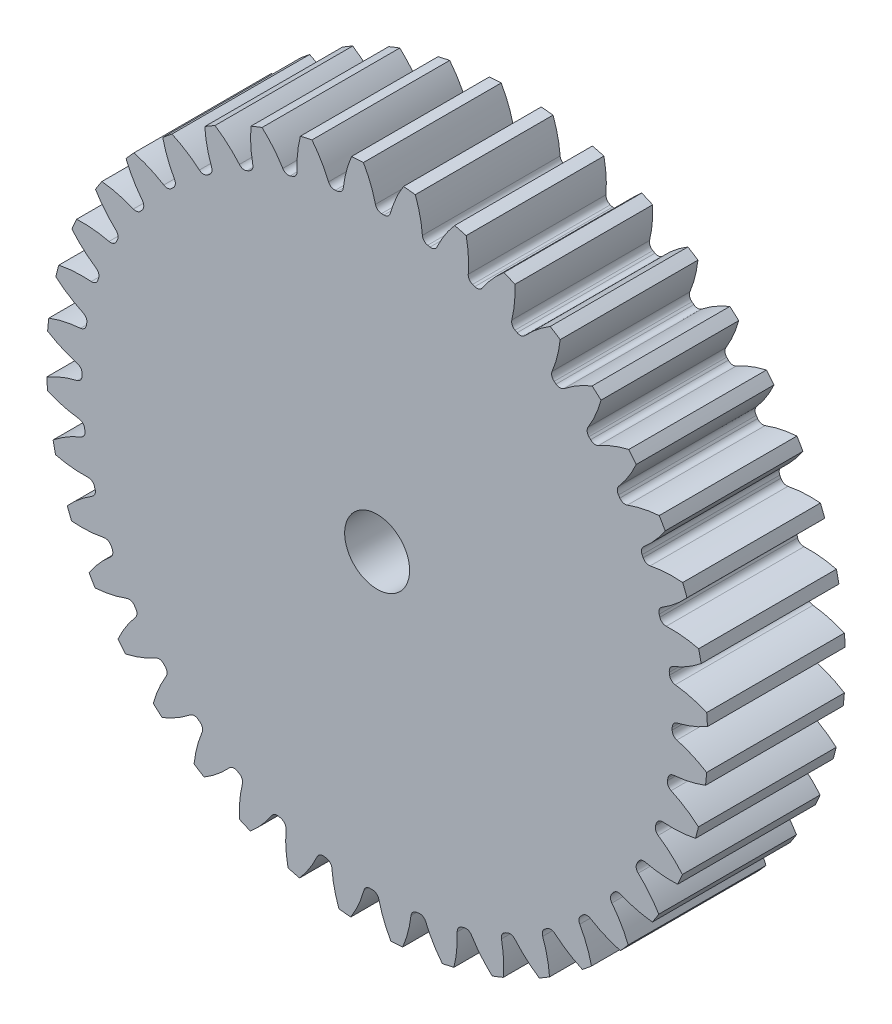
from build123d import *

# Parameters (mm, degrees)
SKETCH3_R         = 213.36
GEARBODY_DEPTH    = 88.9
TOOTHCUT_DEPTH    = 315.56031091
CIRPATTERN1_COUNT = 40
BOREDIA_R         = 20.955
BORE_DEPTH        = 12700


with BuildPart() as part:
    # Sketch3 → gearBody (new body)
    with BuildSketch(Plane.XY):
        Circle(SKETCH3_R)
    extrude(amount=GEARBODY_DEPTH)

    # Sketch2 → toothCut (cut, through all)
    with BuildSketch(Plane.XY):
        with BuildLine():
            ThreePointArc((190.448489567, -4.429765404), (190.465044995, -3.649196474), (190.47840121, -2.868566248))
            ThreePointArc((190.47840121, -2.868566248), (191.385750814, -0.34553984), (193.649940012, 1.090563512))
            ThreePointArc((193.649940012, 1.090563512), (203.787555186, 4.304100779), (213.36, 8.937281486))
            ThreePointArc((213.36, 8.937281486), (213.50791766, -4.090684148), (212.861075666, -17.103422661))
            ThreePointArc((212.861075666, -17.103422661), (203.473128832, -12.106972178), (193.466047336, -8.507474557))
            ThreePointArc((193.466047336, -8.507474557), (191.25852939, -6.985695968), (190.448489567, -4.429765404))
        make_face()
    toothcut = extrude(amount=TOOTHCUT_DEPTH, mode=Mode.SUBTRACT)

    # CirPattern1: toothCut ×40 about axis
    cirpattern1_axis = Axis((0, 0, 0), (0, 0, 1))
    for i in range(1, CIRPATTERN1_COUNT):
        add(toothcut.rotate(cirpattern1_axis, i * 360 / CIRPATTERN1_COUNT), mode=Mode.SUBTRACT)

    # boreDia → bore (cut, symmetric)
    with BuildSketch(Plane.XY):
        Circle(BOREDIA_R)
    extrude(amount=BORE_DEPTH, both=True, mode=Mode.SUBTRACT)


solid = part.part
